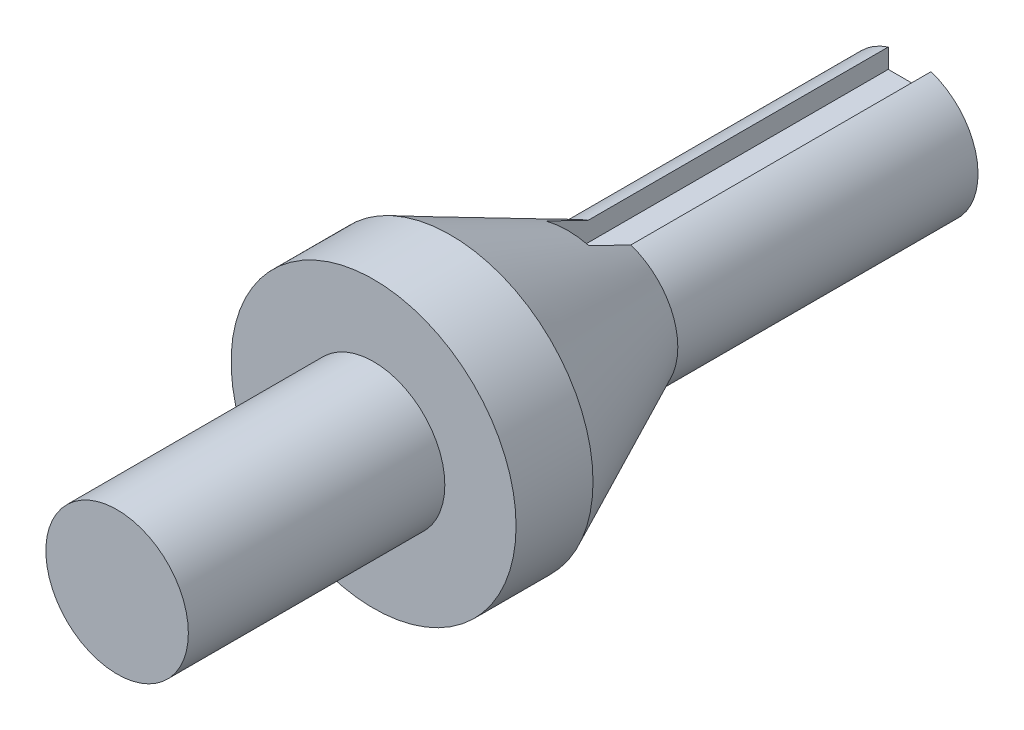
from build123d import *

# Parameters (mm, degrees)
SKETCH2_W          = 1.5
SKETCH2_H          = 1.5
CUT_EXTRUDE1_DEPTH = 12


with BuildPart() as part:
    # Sketch1 → Revolve1 (revolve)
    with BuildSketch(Plane(origin=(0, 0, 0), x_dir=(0, 0, -1), z_dir=(1, 0, 0)), mode=Mode.PRIVATE) as revolve1_sk:
        Polygon((-13.905, 0), (-13.905, 2.5), (-4.905, 2.5), (-4.905, 5), (-2.205, 5), (3.370717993, 2.4), (13.905, 2.4), (13.905, 0), align=None)
    revolve(revolve1_sk.sketch.rotate(Axis((0, 0, 14.482297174), (0, 0, -1)), 90), axis=Axis((0, 0, 14.482297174), (0, 0, -1)))

    # Sketch2 → Cut-Extrude1 (cut)
    with BuildSketch(Plane(origin=(0, 0, -13.905), x_dir=(-1, 0, 0), z_dir=(0, 0, -1))):
        with Locations((0, 2.35)):
            Rectangle(SKETCH2_W, SKETCH2_H)
    extrude(amount=-CUT_EXTRUDE1_DEPTH, mode=Mode.SUBTRACT)


solid = part.part
